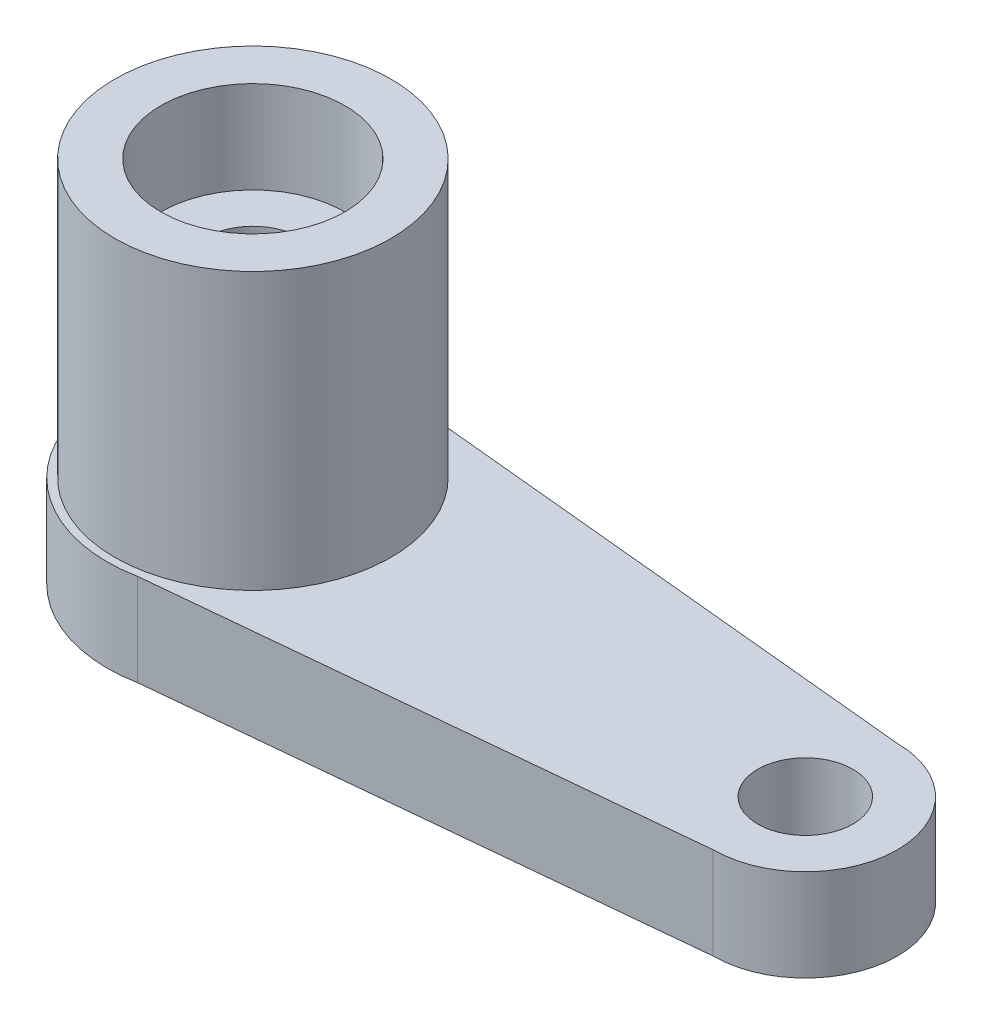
ISO-10303-21;
HEADER;
FILE_DESCRIPTION(('STEP AP214'),'2;1');
FILE_NAME('part.step','',(''),(''),'','','');
FILE_SCHEMA(('AUTOMOTIVE_DESIGN { 1 0 10303 214 1 1 1 1 }'));
ENDSEC;
DATA;
#1=APPLICATION_CONTEXT('core data for automotive mechanical design processes');
#2=APPLICATION_PROTOCOL_DEFINITION('international standard','automotive_design',2000,#1);
#3=PRODUCT_CONTEXT('',#1,'mechanical');
#4=PRODUCT('Part','Part','',(#3));
#5=PRODUCT_RELATED_PRODUCT_CATEGORY('part','',(#4));
#6=PRODUCT_DEFINITION_FORMATION('','',#4);
#7=PRODUCT_DEFINITION_CONTEXT('part definition',#1,'design');
#8=PRODUCT_DEFINITION('design','',#6,#7);
#9=PRODUCT_DEFINITION_SHAPE('','',#8);
#10=(LENGTH_UNIT() NAMED_UNIT(*) SI_UNIT(.MILLI.,.METRE.));
#11=(NAMED_UNIT(*) PLANE_ANGLE_UNIT() SI_UNIT($,.RADIAN.));
#12=(NAMED_UNIT(*) SI_UNIT($,.STERADIAN.) SOLID_ANGLE_UNIT());
#13=UNCERTAINTY_MEASURE_WITH_UNIT(LENGTH_MEASURE(1.E-05),#10,'distance_accuracy_value','');
#14=(GEOMETRIC_REPRESENTATION_CONTEXT(3) GLOBAL_UNCERTAINTY_ASSIGNED_CONTEXT((#13)) GLOBAL_UNIT_ASSIGNED_CONTEXT((#10,
#11,#12)) REPRESENTATION_CONTEXT('',''));
#15=CARTESIAN_POINT('',(0.,0.,0.));
#16=DIRECTION('',(0.,0.,1.));
#17=DIRECTION('',(1.,0.,0.));
#18=AXIS2_PLACEMENT_3D('',#15,#16,#17);
#19=CARTESIAN_POINT('',(0.899999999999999,3.,-4.6639575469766));
#20=DIRECTION('',(0.0968500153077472,0.,-0.995298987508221));
#21=DIRECTION('',(-0.995298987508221,0.,-0.0968500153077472));
#22=AXIS2_PLACEMENT_3D('',#19,#20,#21);
#23=PLANE('',#22);
#24=DIRECTION('',(0.995298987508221,0.,0.0968500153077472));
#25=VECTOR('',#24,1.);
#26=CARTESIAN_POINT('',(0.899999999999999,0.,-4.6639575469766));
#27=LINE('',#26,#25);
#28=CARTESIAN_POINT('',(0.899999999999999,0.,-4.6639575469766));
#29=VERTEX_POINT('',#28);
#30=CARTESIAN_POINT('',(18.,0.,-3.));
#31=VERTEX_POINT('',#30);
#32=EDGE_CURVE('E99',#29,#31,#27,.T.);
#33=ORIENTED_EDGE('',*,*,#32,.F.);
#34=DIRECTION('',(0.,-1.,0.));
#35=VECTOR('',#34,1.);
#36=CARTESIAN_POINT('',(0.899999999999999,3.,-4.6639575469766));
#37=LINE('',#36,#35);
#38=CARTESIAN_POINT('',(0.899999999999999,3.,-4.6639575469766));
#39=VERTEX_POINT('',#38);
#40=EDGE_CURVE('E11',#39,#29,#37,.T.);
#41=ORIENTED_EDGE('',*,*,#40,.F.);
#42=DIRECTION('',(0.995298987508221,0.,0.0968500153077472));
#43=VECTOR('',#42,1.);
#44=CARTESIAN_POINT('',(0.899999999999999,3.,-4.6639575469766));
#45=LINE('',#44,#43);
#46=CARTESIAN_POINT('',(18.,3.,-3.));
#47=VERTEX_POINT('',#46);
#48=EDGE_CURVE('E93',#39,#47,#45,.T.);
#49=ORIENTED_EDGE('',*,*,#48,.T.);
#50=DIRECTION('',(0.,-1.,0.));
#51=VECTOR('',#50,1.);
#52=CARTESIAN_POINT('',(18.,3.,-3.));
#53=LINE('',#52,#51);
#54=EDGE_CURVE('E36',#47,#31,#53,.T.);
#55=ORIENTED_EDGE('',*,*,#54,.T.);
#56=EDGE_LOOP('',(#33,#41,#49,#55));
#57=FACE_BOUND('',#56,.T.);
#58=ADVANCED_FACE('F33',(#57),#23,.T.);
#59=CARTESIAN_POINT('',(0.,3.,0.));
#60=DIRECTION('',(0.,-1.,0.));
#61=DIRECTION('',(0.,0.,-1.));
#62=AXIS2_PLACEMENT_3D('',#59,#60,#61);
#63=CYLINDRICAL_SURFACE('',#62,4.75);
#64=CARTESIAN_POINT('',(0.,0.,0.));
#65=DIRECTION('',(0.,1.,0.));
#66=DIRECTION('',(0.,0.,1.));
#67=AXIS2_PLACEMENT_3D('',#64,#65,#66);
#68=CIRCLE('',#67,4.75);
#69=CARTESIAN_POINT('',(0.900000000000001,0.,4.6639575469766));
#70=VERTEX_POINT('',#69);
#71=EDGE_CURVE('E66',#29,#70,#68,.T.);
#72=ORIENTED_EDGE('',*,*,#71,.T.);
#73=DIRECTION('',(0.,-1.,0.));
#74=VECTOR('',#73,1.);
#75=CARTESIAN_POINT('',(0.900000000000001,3.,4.6639575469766));
#76=LINE('',#75,#74);
#77=CARTESIAN_POINT('',(0.900000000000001,3.,4.6639575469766));
#78=VERTEX_POINT('',#77);
#79=EDGE_CURVE('E42',#78,#70,#76,.T.);
#80=ORIENTED_EDGE('',*,*,#79,.F.);
#81=CARTESIAN_POINT('',(0.,3.,0.));
#82=DIRECTION('',(0.,1.,0.));
#83=DIRECTION('',(0.,0.,1.));
#84=AXIS2_PLACEMENT_3D('',#81,#82,#83);
#85=CIRCLE('',#84,4.75);
#86=EDGE_CURVE('E81',#39,#78,#85,.T.);
#87=ORIENTED_EDGE('',*,*,#86,.F.);
#88=ORIENTED_EDGE('',*,*,#40,.T.);
#89=EDGE_LOOP('',(#72,#80,#87,#88));
#90=FACE_BOUND('',#89,.T.);
#91=ADVANCED_FACE('F110',(#90),#63,.T.);
#92=CARTESIAN_POINT('',(0.900000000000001,3.,4.6639575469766));
#93=DIRECTION('',(-0.0968500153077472,0.,-0.995298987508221));
#94=DIRECTION('',(-0.995298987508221,0.,0.0968500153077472));
#95=AXIS2_PLACEMENT_3D('',#92,#93,#94);
#96=PLANE('',#95);
#97=DIRECTION('',(0.995298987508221,0.,-0.0968500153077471));
#98=VECTOR('',#97,1.);
#99=CARTESIAN_POINT('',(0.900000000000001,0.,4.6639575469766));
#100=LINE('',#99,#98);
#101=CARTESIAN_POINT('',(18.,0.,3.));
#102=VERTEX_POINT('',#101);
#103=EDGE_CURVE('E88',#70,#102,#100,.T.);
#104=ORIENTED_EDGE('',*,*,#103,.T.);
#105=DIRECTION('',(0.,-1.,0.));
#106=VECTOR('',#105,1.);
#107=CARTESIAN_POINT('',(18.,3.,3.));
#108=LINE('',#107,#106);
#109=CARTESIAN_POINT('',(18.,3.,3.));
#110=VERTEX_POINT('',#109);
#111=EDGE_CURVE('E85',#110,#102,#108,.T.);
#112=ORIENTED_EDGE('',*,*,#111,.F.);
#113=DIRECTION('',(0.995298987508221,0.,-0.0968500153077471));
#114=VECTOR('',#113,1.);
#115=CARTESIAN_POINT('',(0.900000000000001,3.,4.6639575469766));
#116=LINE('',#115,#114);
#117=EDGE_CURVE('E78',#78,#110,#116,.T.);
#118=ORIENTED_EDGE('',*,*,#117,.F.);
#119=ORIENTED_EDGE('',*,*,#79,.T.);
#120=EDGE_LOOP('',(#104,#112,#118,#119));
#121=FACE_BOUND('',#120,.T.);
#122=ADVANCED_FACE('F86',(#121),#96,.F.);
#123=CARTESIAN_POINT('',(18.,3.,0.));
#124=DIRECTION('',(0.,-1.,0.));
#125=DIRECTION('',(0.,0.,-1.));
#126=AXIS2_PLACEMENT_3D('',#123,#124,#125);
#127=CYLINDRICAL_SURFACE('',#126,3.);
#128=CARTESIAN_POINT('',(18.,0.,0.));
#129=DIRECTION('',(0.,1.,0.));
#130=DIRECTION('',(0.,0.,1.));
#131=AXIS2_PLACEMENT_3D('',#128,#129,#130);
#132=CIRCLE('',#131,3.);
#133=EDGE_CURVE('E102',#102,#31,#132,.T.);
#134=ORIENTED_EDGE('',*,*,#133,.T.);
#135=ORIENTED_EDGE('',*,*,#54,.F.);
#136=CARTESIAN_POINT('',(18.,3.,0.));
#137=DIRECTION('',(0.,1.,0.));
#138=DIRECTION('',(0.,0.,1.));
#139=AXIS2_PLACEMENT_3D('',#136,#137,#138);
#140=CIRCLE('',#139,3.);
#141=EDGE_CURVE('E75',#110,#47,#140,.T.);
#142=ORIENTED_EDGE('',*,*,#141,.F.);
#143=ORIENTED_EDGE('',*,*,#111,.T.);
#144=EDGE_LOOP('',(#134,#135,#142,#143));
#145=FACE_BOUND('',#144,.T.);
#146=ADVANCED_FACE('F92',(#145),#127,.T.);
#147=CARTESIAN_POINT('',(18.,3.,0.));
#148=DIRECTION('',(0.,1.,0.));
#149=DIRECTION('',(0.,0.,1.));
#150=AXIS2_PLACEMENT_3D('',#147,#148,#149);
#151=PLANE('',#150);
#152=CARTESIAN_POINT('',(0.,3.,0.));
#153=DIRECTION('',(0.,1.,0.));
#154=DIRECTION('',(0.,0.,1.));
#155=AXIS2_PLACEMENT_3D('',#152,#153,#154);
#156=CIRCLE('',#155,4.5);
#157=CARTESIAN_POINT('',(0.,3.,4.5));
#158=VERTEX_POINT('',#157);
#159=EDGE_CURVE('E186',#158,#158,#156,.T.);
#160=ORIENTED_EDGE('',*,*,#159,.F.);
#161=EDGE_LOOP('',(#160));
#162=FACE_BOUND('',#161,.T.);
#163=CARTESIAN_POINT('',(18.,3.,0.));
#164=DIRECTION('',(0.,1.,0.));
#165=DIRECTION('',(0.,0.,1.));
#166=AXIS2_PLACEMENT_3D('',#163,#164,#165);
#167=CIRCLE('',#166,1.55);
#168=CARTESIAN_POINT('',(18.,3.,1.55));
#169=VERTEX_POINT('',#168);
#170=EDGE_CURVE('E192',#169,#169,#167,.T.);
#171=ORIENTED_EDGE('',*,*,#170,.F.);
#172=EDGE_LOOP('',(#171));
#173=FACE_BOUND('',#172,.T.);
#174=ORIENTED_EDGE('',*,*,#48,.F.);
#175=ORIENTED_EDGE('',*,*,#86,.T.);
#176=ORIENTED_EDGE('',*,*,#117,.T.);
#177=ORIENTED_EDGE('',*,*,#141,.T.);
#178=EDGE_LOOP('',(#174,#175,#176,#177));
#179=FACE_BOUND('',#178,.T.);
#180=ADVANCED_FACE('F80',(#162,#173,#179),#151,.T.);
#181=CARTESIAN_POINT('',(18.,0.,0.));
#182=DIRECTION('',(0.,1.,0.));
#183=DIRECTION('',(0.,0.,1.));
#184=AXIS2_PLACEMENT_3D('',#181,#182,#183);
#185=PLANE('',#184);
#186=CARTESIAN_POINT('',(0.,0.,0.));
#187=DIRECTION('',(0.,-1.,0.));
#188=DIRECTION('',(0.,0.,-1.));
#189=AXIS2_PLACEMENT_3D('',#186,#187,#188);
#190=CIRCLE('',#189,3.);
#191=CARTESIAN_POINT('',(0.,0.,-3.));
#192=VERTEX_POINT('',#191);
#193=EDGE_CURVE('E181',#192,#192,#190,.T.);
#194=ORIENTED_EDGE('',*,*,#193,.F.);
#195=EDGE_LOOP('',(#194));
#196=FACE_BOUND('',#195,.T.);
#197=CARTESIAN_POINT('',(18.,0.,0.));
#198=DIRECTION('',(0.,1.,0.));
#199=DIRECTION('',(0.,0.,1.));
#200=AXIS2_PLACEMENT_3D('',#197,#198,#199);
#201=CIRCLE('',#200,1.55);
#202=CARTESIAN_POINT('',(18.,0.,1.55));
#203=VERTEX_POINT('',#202);
#204=EDGE_CURVE('E103',#203,#203,#201,.F.);
#205=ORIENTED_EDGE('',*,*,#204,.F.);
#206=EDGE_LOOP('',(#205));
#207=FACE_BOUND('',#206,.T.);
#208=ORIENTED_EDGE('',*,*,#32,.T.);
#209=ORIENTED_EDGE('',*,*,#133,.F.);
#210=ORIENTED_EDGE('',*,*,#103,.F.);
#211=ORIENTED_EDGE('',*,*,#71,.F.);
#212=EDGE_LOOP('',(#208,#209,#210,#211));
#213=FACE_BOUND('',#212,.T.);
#214=ADVANCED_FACE('F108',(#196,#207,#213),#185,.F.);
#215=CARTESIAN_POINT('',(18.,-0.00100000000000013,0.));
#216=DIRECTION('',(0.,1.,0.));
#217=DIRECTION('',(0.,0.,1.));
#218=AXIS2_PLACEMENT_3D('',#215,#216,#217);
#219=CYLINDRICAL_SURFACE('',#218,1.55);
#220=CARTESIAN_POINT('',(18.,3.,1.55));
#221=CARTESIAN_POINT('',(18.,2.96875,1.55));
#222=CARTESIAN_POINT('',(18.,2.9375,1.55));
#223=CARTESIAN_POINT('',(18.,2.875,1.55));
#224=CARTESIAN_POINT('',(18.,2.84375,1.55));
#225=CARTESIAN_POINT('',(18.,2.78125,1.55));
#226=CARTESIAN_POINT('',(18.,2.75,1.55));
#227=CARTESIAN_POINT('',(18.,2.6875,1.55));
#228=CARTESIAN_POINT('',(18.,2.65625,1.55));
#229=CARTESIAN_POINT('',(18.,2.59375,1.55));
#230=CARTESIAN_POINT('',(18.,2.5625,1.55));
#231=CARTESIAN_POINT('',(18.,2.5,1.55));
#232=CARTESIAN_POINT('',(18.,2.46875,1.55));
#233=CARTESIAN_POINT('',(18.,2.40625,1.55));
#234=CARTESIAN_POINT('',(18.,2.375,1.55));
#235=CARTESIAN_POINT('',(18.,2.3125,1.55));
#236=CARTESIAN_POINT('',(18.,2.28125,1.55));
#237=CARTESIAN_POINT('',(18.,2.21875,1.55));
#238=CARTESIAN_POINT('',(18.,2.1875,1.55));
#239=CARTESIAN_POINT('',(18.,2.125,1.55));
#240=CARTESIAN_POINT('',(18.,2.09375,1.55));
#241=CARTESIAN_POINT('',(18.,2.03125,1.55));
#242=CARTESIAN_POINT('',(18.,2.,1.55));
#243=CARTESIAN_POINT('',(18.,1.9375,1.55));
#244=CARTESIAN_POINT('',(18.,1.90625,1.55));
#245=CARTESIAN_POINT('',(18.,1.84375,1.55));
#246=CARTESIAN_POINT('',(18.,1.8125,1.55));
#247=CARTESIAN_POINT('',(18.,1.75,1.55));
#248=CARTESIAN_POINT('',(18.,1.71875,1.55));
#249=CARTESIAN_POINT('',(18.,1.65625,1.55));
#250=CARTESIAN_POINT('',(18.,1.625,1.55));
#251=CARTESIAN_POINT('',(18.,1.5625,1.55));
#252=CARTESIAN_POINT('',(18.,1.53125,1.55));
#253=CARTESIAN_POINT('',(18.,1.46875,1.55));
#254=CARTESIAN_POINT('',(18.,1.4375,1.55));
#255=CARTESIAN_POINT('',(18.,1.375,1.55));
#256=CARTESIAN_POINT('',(18.,1.34375,1.55));
#257=CARTESIAN_POINT('',(18.,1.28125,1.55));
#258=CARTESIAN_POINT('',(18.,1.25,1.55));
#259=CARTESIAN_POINT('',(18.,1.1875,1.55));
#260=CARTESIAN_POINT('',(18.,1.15625,1.55));
#261=CARTESIAN_POINT('',(18.,1.09375,1.55));
#262=CARTESIAN_POINT('',(18.,1.0625,1.55));
#263=CARTESIAN_POINT('',(18.,1.,1.55));
#264=CARTESIAN_POINT('',(18.,0.96875,1.55));
#265=CARTESIAN_POINT('',(18.,0.90625,1.55));
#266=CARTESIAN_POINT('',(18.,0.875,1.55));
#267=CARTESIAN_POINT('',(18.,0.8125,1.55));
#268=CARTESIAN_POINT('',(18.,0.78125,1.55));
#269=CARTESIAN_POINT('',(18.,0.71875,1.55));
#270=CARTESIAN_POINT('',(18.,0.6875,1.55));
#271=CARTESIAN_POINT('',(18.,0.625,1.55));
#272=CARTESIAN_POINT('',(18.,0.59375,1.55));
#273=CARTESIAN_POINT('',(18.,0.53125,1.55));
#274=CARTESIAN_POINT('',(18.,0.5,1.55));
#275=CARTESIAN_POINT('',(18.,0.4375,1.55));
#276=CARTESIAN_POINT('',(18.,0.40625,1.55));
#277=CARTESIAN_POINT('',(18.,0.34375,1.55));
#278=CARTESIAN_POINT('',(18.,0.3125,1.55));
#279=CARTESIAN_POINT('',(18.,0.25,1.55));
#280=CARTESIAN_POINT('',(18.,0.21875,1.55));
#281=CARTESIAN_POINT('',(18.,0.15625,1.55));
#282=CARTESIAN_POINT('',(18.,0.125,1.55));
#283=CARTESIAN_POINT('',(18.,0.0625000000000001,1.55));
#284=CARTESIAN_POINT('',(18.,0.0312500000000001,1.55));
#285=CARTESIAN_POINT('',(18.,0.,1.55));
#286=B_SPLINE_CURVE_WITH_KNOTS('',3,(#220,#221,#222,#223,#224,#225,#226,#227,#228,#229,#230,
#231,#232,#233,#234,#235,#236,#237,#238,#239,#240,#241,#242,#243,#244,#245,#246,#247,#248,#249,
#250,#251,#252,#253,#254,#255,#256,#257,#258,#259,#260,#261,#262,#263,#264,#265,#266,#267,#268,
#269,#270,#271,#272,#273,#274,#275,#276,#277,#278,#279,#280,#281,#282,#283,#284,#285),
.UNSPECIFIED.,.F.,.F.,(4,2,2,2,2,2,2,2,2,2,2,2,2,2,2,2,2,2,2,2,2,2,2,2,2,2,2,2,2,2,2,2,4),(0.,
0.0937500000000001,0.1875,0.28125,0.375,0.46875,0.5625,0.65625,0.75,0.84375,0.9375,1.03125,
1.125,1.21875,1.3125,1.40625,1.5,1.59375,1.6875,1.78125,1.875,1.96875,2.0625,2.15625,2.25,
2.34375,2.4375,2.53125,2.625,2.71875,2.8125,2.90625,3.),.UNSPECIFIED.);
#287=EDGE_CURVE('BSEAM129',#169,#203,#286,.T.);
#288=ORIENTED_EDGE('',*,*,#170,.T.);
#289=ORIENTED_EDGE('',*,*,#204,.T.);
#290=ORIENTED_EDGE('',*,*,#287,.T.);
#291=ORIENTED_EDGE('',*,*,#287,.F.);
#292=EDGE_LOOP('',(#288,#290,#289,#291));
#293=FACE_BOUND('',#292,.T.);
#294=ADVANCED_FACE('F129',(#293),#219,.F.);
#295=CARTESIAN_POINT('',(0.,12.,0.));
#296=DIRECTION('',(0.,-1.,0.));
#297=DIRECTION('',(0.,0.,-1.));
#298=AXIS2_PLACEMENT_3D('',#295,#296,#297);
#299=CYLINDRICAL_SURFACE('',#298,4.5);
#300=CARTESIAN_POINT('',(0.,12.,0.));
#301=DIRECTION('',(0.,1.,0.));
#302=DIRECTION('',(0.,0.,1.));
#303=AXIS2_PLACEMENT_3D('',#300,#301,#302);
#304=CIRCLE('',#303,4.5);
#305=CARTESIAN_POINT('',(0.,12.,4.5));
#306=VERTEX_POINT('',#305);
#307=EDGE_CURVE('E189',#306,#306,#304,.T.);
#308=ORIENTED_EDGE('',*,*,#307,.F.);
#309=EDGE_LOOP('',(#308));
#310=FACE_BOUND('',#309,.T.);
#311=ORIENTED_EDGE('',*,*,#159,.T.);
#312=EDGE_LOOP('',(#311));
#313=FACE_BOUND('',#312,.T.);
#314=ADVANCED_FACE('F136',(#310,#313),#299,.T.);
#315=CARTESIAN_POINT('',(0.,12.,0.));
#316=DIRECTION('',(0.,1.,0.));
#317=DIRECTION('',(0.,0.,1.));
#318=AXIS2_PLACEMENT_3D('',#315,#316,#317);
#319=PLANE('',#318);
#320=CARTESIAN_POINT('',(0.,12.,0.));
#321=DIRECTION('',(0.,1.,0.));
#322=DIRECTION('',(0.,0.,1.));
#323=AXIS2_PLACEMENT_3D('',#320,#321,#322);
#324=CIRCLE('',#323,3.);
#325=CARTESIAN_POINT('',(0.,12.,3.));
#326=VERTEX_POINT('',#325);
#327=EDGE_CURVE('E173',#326,#326,#324,.T.);
#328=ORIENTED_EDGE('',*,*,#327,.F.);
#329=EDGE_LOOP('',(#328));
#330=FACE_BOUND('',#329,.T.);
#331=ORIENTED_EDGE('',*,*,#307,.T.);
#332=EDGE_LOOP('',(#331));
#333=FACE_BOUND('',#332,.T.);
#334=ADVANCED_FACE('F140',(#330,#333),#319,.T.);
#335=CARTESIAN_POINT('',(0.,2.5,0.));
#336=DIRECTION('',(0.,-1.,0.));
#337=DIRECTION('',(0.,0.,-1.));
#338=AXIS2_PLACEMENT_3D('',#335,#336,#337);
#339=CYLINDRICAL_SURFACE('',#338,3.);
#340=CARTESIAN_POINT('',(0.,2.5,0.));
#341=DIRECTION('',(0.,-1.,0.));
#342=DIRECTION('',(0.,0.,-1.));
#343=AXIS2_PLACEMENT_3D('',#340,#341,#342);
#344=CIRCLE('',#343,3.);
#345=CARTESIAN_POINT('',(0.,2.5,-3.));
#346=VERTEX_POINT('',#345);
#347=EDGE_CURVE('E183',#346,#346,#344,.T.);
#348=ORIENTED_EDGE('',*,*,#347,.F.);
#349=EDGE_LOOP('',(#348));
#350=FACE_BOUND('',#349,.T.);
#351=ORIENTED_EDGE('',*,*,#193,.T.);
#352=EDGE_LOOP('',(#351));
#353=FACE_BOUND('',#352,.T.);
#354=ADVANCED_FACE('F144',(#350,#353),#339,.F.);
#355=CARTESIAN_POINT('',(0.,2.5,0.));
#356=DIRECTION('',(0.,-1.,0.));
#357=DIRECTION('',(0.,0.,-1.));
#358=AXIS2_PLACEMENT_3D('',#355,#356,#357);
#359=PLANE('',#358);
#360=CARTESIAN_POINT('',(0.,2.5,0.));
#361=DIRECTION('',(0.,-1.,0.));
#362=DIRECTION('',(0.,0.,-1.));
#363=AXIS2_PLACEMENT_3D('',#360,#361,#362);
#364=CIRCLE('',#363,1.55);
#365=CARTESIAN_POINT('',(0.,2.5,-1.55));
#366=VERTEX_POINT('',#365);
#367=EDGE_CURVE('E169',#366,#366,#364,.F.);
#368=ORIENTED_EDGE('',*,*,#367,.T.);
#369=EDGE_LOOP('',(#368));
#370=FACE_BOUND('',#369,.T.);
#371=ORIENTED_EDGE('',*,*,#347,.T.);
#372=EDGE_LOOP('',(#371));
#373=FACE_BOUND('',#372,.T.);
#374=ADVANCED_FACE('F148',(#370,#373),#359,.T.);
#375=CARTESIAN_POINT('',(0.,9.,0.));
#376=DIRECTION('',(0.,1.,0.));
#377=DIRECTION('',(0.,0.,1.));
#378=AXIS2_PLACEMENT_3D('',#375,#376,#377);
#379=CYLINDRICAL_SURFACE('',#378,3.);
#380=CARTESIAN_POINT('',(0.,9.,0.));
#381=DIRECTION('',(0.,1.,0.));
#382=DIRECTION('',(0.,0.,1.));
#383=AXIS2_PLACEMENT_3D('',#380,#381,#382);
#384=CIRCLE('',#383,3.);
#385=CARTESIAN_POINT('',(0.,9.,3.));
#386=VERTEX_POINT('',#385);
#387=EDGE_CURVE('E176',#386,#386,#384,.T.);
#388=ORIENTED_EDGE('',*,*,#387,.F.);
#389=EDGE_LOOP('',(#388));
#390=FACE_BOUND('',#389,.T.);
#391=ORIENTED_EDGE('',*,*,#327,.T.);
#392=EDGE_LOOP('',(#391));
#393=FACE_BOUND('',#392,.T.);
#394=ADVANCED_FACE('F152',(#390,#393),#379,.F.);
#395=CARTESIAN_POINT('',(0.,9.,0.));
#396=DIRECTION('',(0.,1.,0.));
#397=DIRECTION('',(0.,0.,1.));
#398=AXIS2_PLACEMENT_3D('',#395,#396,#397);
#399=PLANE('',#398);
#400=CARTESIAN_POINT('',(0.,9.,0.));
#401=DIRECTION('',(0.,1.,0.));
#402=DIRECTION('',(0.,0.,1.));
#403=AXIS2_PLACEMENT_3D('',#400,#401,#402);
#404=CIRCLE('',#403,1.55);
#405=CARTESIAN_POINT('',(0.,9.,1.55));
#406=VERTEX_POINT('',#405);
#407=EDGE_CURVE('E172',#406,#406,#404,.T.);
#408=ORIENTED_EDGE('',*,*,#407,.F.);
#409=EDGE_LOOP('',(#408));
#410=FACE_BOUND('',#409,.T.);
#411=ORIENTED_EDGE('',*,*,#387,.T.);
#412=EDGE_LOOP('',(#411));
#413=FACE_BOUND('',#412,.T.);
#414=ADVANCED_FACE('F156',(#410,#413),#399,.T.);
#415=CARTESIAN_POINT('',(0.,-0.000999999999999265,0.));
#416=DIRECTION('',(0.,1.,0.));
#417=DIRECTION('',(0.,0.,1.));
#418=AXIS2_PLACEMENT_3D('',#415,#416,#417);
#419=CYLINDRICAL_SURFACE('',#418,1.55);
#420=ORIENTED_EDGE('',*,*,#367,.F.);
#421=EDGE_LOOP('',(#420));
#422=FACE_BOUND('',#421,.T.);
#423=ORIENTED_EDGE('',*,*,#407,.T.);
#424=EDGE_LOOP('',(#423));
#425=FACE_BOUND('',#424,.T.);
#426=ADVANCED_FACE('F160',(#422,#425),#419,.F.);
#427=CLOSED_SHELL('',(#58,#91,#122,#146,#180,#214,#294,#314,#334,#354,#374,#394,#414,#426));
#428=MANIFOLD_SOLID_BREP('B2',#427);
#429=ADVANCED_BREP_SHAPE_REPRESENTATION('',(#18,#428),#14);
#430=SHAPE_DEFINITION_REPRESENTATION(#9,#429);
ENDSEC;
END-ISO-10303-21;
